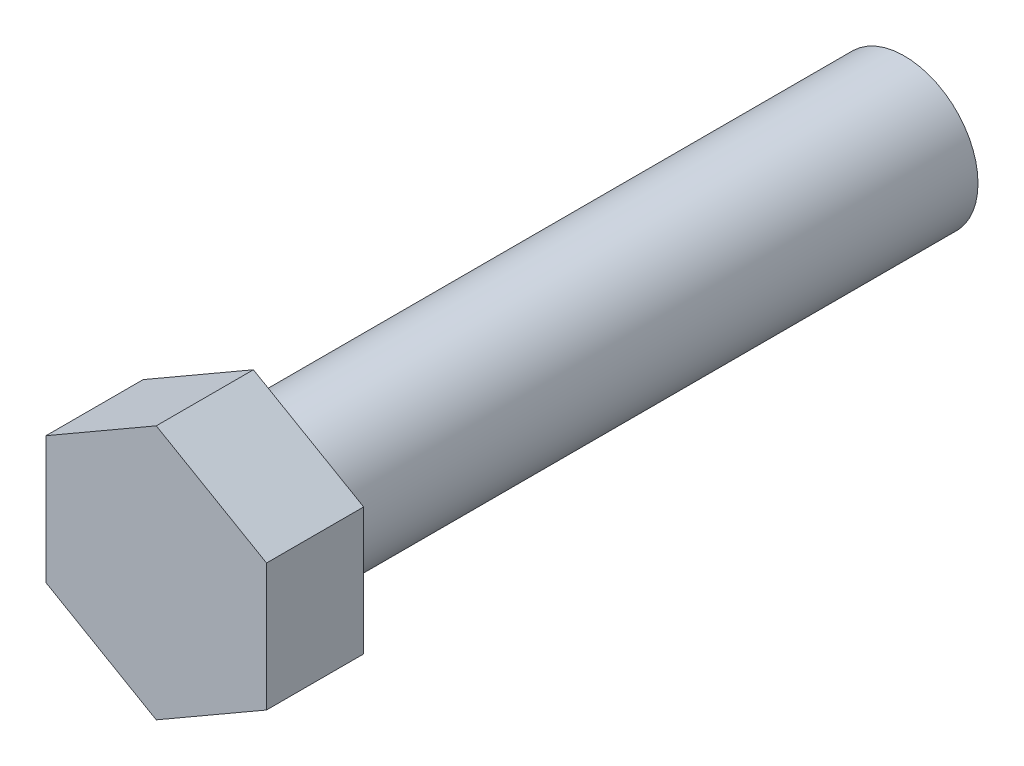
ISO-10303-21;
HEADER;
FILE_DESCRIPTION(('STEP AP214'),'2;1');
FILE_NAME('part.step','',(''),(''),'','','');
FILE_SCHEMA(('AUTOMOTIVE_DESIGN { 1 0 10303 214 1 1 1 1 }'));
ENDSEC;
DATA;
#1=APPLICATION_CONTEXT('core data for automotive mechanical design processes');
#2=APPLICATION_PROTOCOL_DEFINITION('international standard','automotive_design',2000,#1);
#3=PRODUCT_CONTEXT('',#1,'mechanical');
#4=PRODUCT('Part','Part','',(#3));
#5=PRODUCT_RELATED_PRODUCT_CATEGORY('part','',(#4));
#6=PRODUCT_DEFINITION_FORMATION('','',#4);
#7=PRODUCT_DEFINITION_CONTEXT('part definition',#1,'design');
#8=PRODUCT_DEFINITION('design','',#6,#7);
#9=PRODUCT_DEFINITION_SHAPE('','',#8);
#10=(LENGTH_UNIT() NAMED_UNIT(*) SI_UNIT(.MILLI.,.METRE.));
#11=(NAMED_UNIT(*) PLANE_ANGLE_UNIT() SI_UNIT($,.RADIAN.));
#12=(NAMED_UNIT(*) SI_UNIT($,.STERADIAN.) SOLID_ANGLE_UNIT());
#13=UNCERTAINTY_MEASURE_WITH_UNIT(LENGTH_MEASURE(1.E-05),#10,'distance_accuracy_value','');
#14=(GEOMETRIC_REPRESENTATION_CONTEXT(3) GLOBAL_UNCERTAINTY_ASSIGNED_CONTEXT((#13)) GLOBAL_UNIT_ASSIGNED_CONTEXT((#10,
#11,#12)) REPRESENTATION_CONTEXT('',''));
#15=CARTESIAN_POINT('',(0.,0.,0.));
#16=DIRECTION('',(0.,0.,1.));
#17=DIRECTION('',(1.,0.,0.));
#18=AXIS2_PLACEMENT_3D('',#15,#16,#17);
#19=CARTESIAN_POINT('',(66.675,38.4948291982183,58.7375));
#20=DIRECTION('',(-0.5,-0.866025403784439,0.));
#21=DIRECTION('',(0.866025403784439,-0.5,0.));
#22=AXIS2_PLACEMENT_3D('',#19,#20,#21);
#23=PLANE('',#22);
#24=DIRECTION('',(-0.866025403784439,0.5,0.));
#25=VECTOR('',#24,1.);
#26=CARTESIAN_POINT('',(66.675,38.4948291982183,0.));
#27=LINE('',#26,#25);
#28=CARTESIAN_POINT('',(66.675,38.4948291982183,0.));
#29=VERTEX_POINT('',#28);
#30=CARTESIAN_POINT('',(0.,76.9896583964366,0.));
#31=VERTEX_POINT('',#30);
#32=EDGE_CURVE('E132',#29,#31,#27,.T.);
#33=ORIENTED_EDGE('',*,*,#32,.T.);
#34=DIRECTION('',(0.,0.,-1.));
#35=VECTOR('',#34,1.);
#36=CARTESIAN_POINT('',(0.,76.9896583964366,58.7375));
#37=LINE('',#36,#35);
#38=CARTESIAN_POINT('',(0.,76.9896583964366,58.7375));
#39=VERTEX_POINT('',#38);
#40=EDGE_CURVE('E11',#39,#31,#37,.T.);
#41=ORIENTED_EDGE('',*,*,#40,.F.);
#42=DIRECTION('',(-0.866025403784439,0.5,0.));
#43=VECTOR('',#42,1.);
#44=CARTESIAN_POINT('',(66.675,38.4948291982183,58.7375));
#45=LINE('',#44,#43);
#46=CARTESIAN_POINT('',(66.675,38.4948291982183,58.7375));
#47=VERTEX_POINT('',#46);
#48=EDGE_CURVE('E147',#47,#39,#45,.T.);
#49=ORIENTED_EDGE('',*,*,#48,.F.);
#50=DIRECTION('',(0.,0.,-1.));
#51=VECTOR('',#50,1.);
#52=CARTESIAN_POINT('',(66.675,38.4948291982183,58.7375));
#53=LINE('',#52,#51);
#54=EDGE_CURVE('E129',#47,#29,#53,.T.);
#55=ORIENTED_EDGE('',*,*,#54,.T.);
#56=EDGE_LOOP('',(#33,#41,#49,#55));
#57=FACE_BOUND('',#56,.T.);
#58=ADVANCED_FACE('F42',(#57),#23,.F.);
#59=CARTESIAN_POINT('',(0.,76.9896583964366,58.7375));
#60=DIRECTION('',(0.5,-0.866025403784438,0.));
#61=DIRECTION('',(0.866025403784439,0.5,0.));
#62=AXIS2_PLACEMENT_3D('',#59,#60,#61);
#63=PLANE('',#62);
#64=DIRECTION('',(-0.866025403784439,-0.5,0.));
#65=VECTOR('',#64,1.);
#66=CARTESIAN_POINT('',(0.,76.9896583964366,0.));
#67=LINE('',#66,#65);
#68=CARTESIAN_POINT('',(-66.6750000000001,38.4948291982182,0.));
#69=VERTEX_POINT('',#68);
#70=EDGE_CURVE('E140',#31,#69,#67,.T.);
#71=ORIENTED_EDGE('',*,*,#70,.T.);
#72=DIRECTION('',(0.,0.,-1.));
#73=VECTOR('',#72,1.);
#74=CARTESIAN_POINT('',(-66.6750000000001,38.4948291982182,58.7375));
#75=LINE('',#74,#73);
#76=CARTESIAN_POINT('',(-66.6750000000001,38.4948291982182,58.7375));
#77=VERTEX_POINT('',#76);
#78=EDGE_CURVE('E52',#77,#69,#75,.T.);
#79=ORIENTED_EDGE('',*,*,#78,.F.);
#80=DIRECTION('',(-0.866025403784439,-0.5,0.));
#81=VECTOR('',#80,1.);
#82=CARTESIAN_POINT('',(0.,76.9896583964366,58.7375));
#83=LINE('',#82,#81);
#84=EDGE_CURVE('E98',#39,#77,#83,.T.);
#85=ORIENTED_EDGE('',*,*,#84,.F.);
#86=ORIENTED_EDGE('',*,*,#40,.T.);
#87=EDGE_LOOP('',(#71,#79,#85,#86));
#88=FACE_BOUND('',#87,.T.);
#89=ADVANCED_FACE('F176',(#88),#63,.F.);
#90=CARTESIAN_POINT('',(-66.6750000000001,38.4948291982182,58.7375));
#91=DIRECTION('',(1.,0.,0.));
#92=DIRECTION('',(0.,1.,0.));
#93=AXIS2_PLACEMENT_3D('',#90,#91,#92);
#94=PLANE('',#93);
#95=DIRECTION('',(0.,-1.,0.));
#96=VECTOR('',#95,1.);
#97=CARTESIAN_POINT('',(-66.6750000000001,38.4948291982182,0.));
#98=LINE('',#97,#96);
#99=CARTESIAN_POINT('',(-66.6750000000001,-38.4948291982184,0.));
#100=VERTEX_POINT('',#99);
#101=EDGE_CURVE('E143',#69,#100,#98,.T.);
#102=ORIENTED_EDGE('',*,*,#101,.T.);
#103=DIRECTION('',(0.,0.,-1.));
#104=VECTOR('',#103,1.);
#105=CARTESIAN_POINT('',(-66.6750000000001,-38.4948291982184,58.7375));
#106=LINE('',#105,#104);
#107=CARTESIAN_POINT('',(-66.6750000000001,-38.4948291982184,58.7375));
#108=VERTEX_POINT('',#107);
#109=EDGE_CURVE('E125',#108,#100,#106,.T.);
#110=ORIENTED_EDGE('',*,*,#109,.F.);
#111=DIRECTION('',(0.,-1.,0.));
#112=VECTOR('',#111,1.);
#113=CARTESIAN_POINT('',(-66.6750000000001,38.4948291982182,58.7375));
#114=LINE('',#113,#112);
#115=EDGE_CURVE('E112',#77,#108,#114,.T.);
#116=ORIENTED_EDGE('',*,*,#115,.F.);
#117=ORIENTED_EDGE('',*,*,#78,.T.);
#118=EDGE_LOOP('',(#102,#110,#116,#117));
#119=FACE_BOUND('',#118,.T.);
#120=ADVANCED_FACE('F159',(#119),#94,.F.);
#121=CARTESIAN_POINT('',(-66.6750000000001,-38.4948291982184,58.7375));
#122=DIRECTION('',(0.5,0.866025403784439,0.));
#123=DIRECTION('',(-0.866025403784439,0.5,0.));
#124=AXIS2_PLACEMENT_3D('',#121,#122,#123);
#125=PLANE('',#124);
#126=DIRECTION('',(0.866025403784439,-0.5,0.));
#127=VECTOR('',#126,1.);
#128=CARTESIAN_POINT('',(-66.6750000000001,-38.4948291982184,0.));
#129=LINE('',#128,#127);
#130=CARTESIAN_POINT('',(0.,-76.9896583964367,0.));
#131=VERTEX_POINT('',#130);
#132=EDGE_CURVE('E119',#100,#131,#129,.T.);
#133=ORIENTED_EDGE('',*,*,#132,.T.);
#134=DIRECTION('',(0.,0.,-1.));
#135=VECTOR('',#134,1.);
#136=CARTESIAN_POINT('',(0.,-76.9896583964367,58.7375));
#137=LINE('',#136,#135);
#138=CARTESIAN_POINT('',(0.,-76.9896583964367,58.7375));
#139=VERTEX_POINT('',#138);
#140=EDGE_CURVE('E120',#139,#131,#137,.T.);
#141=ORIENTED_EDGE('',*,*,#140,.F.);
#142=DIRECTION('',(0.866025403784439,-0.5,0.));
#143=VECTOR('',#142,1.);
#144=CARTESIAN_POINT('',(-66.6750000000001,-38.4948291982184,58.7375));
#145=LINE('',#144,#143);
#146=EDGE_CURVE('E104',#108,#139,#145,.T.);
#147=ORIENTED_EDGE('',*,*,#146,.F.);
#148=ORIENTED_EDGE('',*,*,#109,.T.);
#149=EDGE_LOOP('',(#133,#141,#147,#148));
#150=FACE_BOUND('',#149,.T.);
#151=ADVANCED_FACE('F117',(#150),#125,.F.);
#152=CARTESIAN_POINT('',(0.,-76.9896583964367,58.7375));
#153=DIRECTION('',(-0.5,0.866025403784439,0.));
#154=DIRECTION('',(-0.866025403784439,-0.5,0.));
#155=AXIS2_PLACEMENT_3D('',#152,#153,#154);
#156=PLANE('',#155);
#157=DIRECTION('',(0.866025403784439,0.5,0.));
#158=VECTOR('',#157,1.);
#159=CARTESIAN_POINT('',(0.,-76.9896583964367,0.));
#160=LINE('',#159,#158);
#161=CARTESIAN_POINT('',(66.675,-38.4948291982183,0.));
#162=VERTEX_POINT('',#161);
#163=EDGE_CURVE('E84',#131,#162,#160,.T.);
#164=ORIENTED_EDGE('',*,*,#163,.T.);
#165=DIRECTION('',(0.,0.,-1.));
#166=VECTOR('',#165,1.);
#167=CARTESIAN_POINT('',(66.675,-38.4948291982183,58.7375));
#168=LINE('',#167,#166);
#169=CARTESIAN_POINT('',(66.675,-38.4948291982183,58.7375));
#170=VERTEX_POINT('',#169);
#171=EDGE_CURVE('E121',#170,#162,#168,.T.);
#172=ORIENTED_EDGE('',*,*,#171,.F.);
#173=DIRECTION('',(0.866025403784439,0.5,0.));
#174=VECTOR('',#173,1.);
#175=CARTESIAN_POINT('',(0.,-76.9896583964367,58.7375));
#176=LINE('',#175,#174);
#177=EDGE_CURVE('E108',#139,#170,#176,.T.);
#178=ORIENTED_EDGE('',*,*,#177,.F.);
#179=ORIENTED_EDGE('',*,*,#140,.T.);
#180=EDGE_LOOP('',(#164,#172,#178,#179));
#181=FACE_BOUND('',#180,.T.);
#182=ADVANCED_FACE('F122',(#181),#156,.F.);
#183=CARTESIAN_POINT('',(66.675,-38.4948291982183,58.7375));
#184=DIRECTION('',(-1.,0.,0.));
#185=DIRECTION('',(0.,0.,1.));
#186=AXIS2_PLACEMENT_3D('',#183,#184,#185);
#187=PLANE('',#186);
#188=DIRECTION('',(0.,1.,0.));
#189=VECTOR('',#188,1.);
#190=CARTESIAN_POINT('',(66.675,-38.4948291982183,0.));
#191=LINE('',#190,#189);
#192=EDGE_CURVE('E89',#162,#29,#191,.T.);
#193=ORIENTED_EDGE('',*,*,#192,.T.);
#194=ORIENTED_EDGE('',*,*,#54,.F.);
#195=DIRECTION('',(0.,1.,0.));
#196=VECTOR('',#195,1.);
#197=CARTESIAN_POINT('',(66.675,-38.4948291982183,58.7375));
#198=LINE('',#197,#196);
#199=EDGE_CURVE('E61',#170,#47,#198,.T.);
#200=ORIENTED_EDGE('',*,*,#199,.F.);
#201=ORIENTED_EDGE('',*,*,#171,.T.);
#202=EDGE_LOOP('',(#193,#194,#200,#201));
#203=FACE_BOUND('',#202,.T.);
#204=ADVANCED_FACE('F170',(#203),#187,.F.);
#205=CARTESIAN_POINT('',(0.,0.,58.7375));
#206=DIRECTION('',(0.,0.,1.));
#207=DIRECTION('',(1.,0.,0.));
#208=AXIS2_PLACEMENT_3D('',#205,#206,#207);
#209=PLANE('',#208);
#210=ORIENTED_EDGE('',*,*,#48,.T.);
#211=ORIENTED_EDGE('',*,*,#84,.T.);
#212=ORIENTED_EDGE('',*,*,#115,.T.);
#213=ORIENTED_EDGE('',*,*,#146,.T.);
#214=ORIENTED_EDGE('',*,*,#177,.T.);
#215=ORIENTED_EDGE('',*,*,#199,.T.);
#216=EDGE_LOOP('',(#210,#211,#212,#213,#214,#215));
#217=FACE_BOUND('',#216,.T.);
#218=ADVANCED_FACE('F110',(#217),#209,.T.);
#219=CARTESIAN_POINT('',(0.,0.,0.));
#220=DIRECTION('',(0.,0.,1.));
#221=DIRECTION('',(1.,0.,0.));
#222=AXIS2_PLACEMENT_3D('',#219,#220,#221);
#223=PLANE('',#222);
#224=CARTESIAN_POINT('',(0.,0.,0.));
#225=DIRECTION('',(0.,0.,1.));
#226=DIRECTION('',(1.,0.,0.));
#227=AXIS2_PLACEMENT_3D('',#224,#225,#226);
#228=CIRCLE('',#227,44.45);
#229=CARTESIAN_POINT('',(44.45,0.,0.));
#230=VERTEX_POINT('',#229);
#231=EDGE_CURVE('E245',#230,#230,#228,.T.);
#232=ORIENTED_EDGE('',*,*,#231,.T.);
#233=EDGE_LOOP('',(#232));
#234=FACE_BOUND('',#233,.T.);
#235=ORIENTED_EDGE('',*,*,#32,.F.);
#236=ORIENTED_EDGE('',*,*,#192,.F.);
#237=ORIENTED_EDGE('',*,*,#163,.F.);
#238=ORIENTED_EDGE('',*,*,#132,.F.);
#239=ORIENTED_EDGE('',*,*,#101,.F.);
#240=ORIENTED_EDGE('',*,*,#70,.F.);
#241=EDGE_LOOP('',(#235,#236,#237,#238,#239,#240));
#242=FACE_BOUND('',#241,.T.);
#243=ADVANCED_FACE('F162',(#234,#242),#223,.F.);
#244=CARTESIAN_POINT('',(0.,0.,-393.7));
#245=DIRECTION('',(0.,0.,1.));
#246=DIRECTION('',(1.,0.,0.));
#247=AXIS2_PLACEMENT_3D('',#244,#245,#246);
#248=CYLINDRICAL_SURFACE('',#247,44.45);
#249=CARTESIAN_POINT('',(0.,0.,-393.7));
#250=DIRECTION('',(0.,0.,1.));
#251=DIRECTION('',(1.,0.,0.));
#252=AXIS2_PLACEMENT_3D('',#249,#250,#251);
#253=CIRCLE('',#252,44.45);
#254=CARTESIAN_POINT('',(44.45,0.,-393.7));
#255=VERTEX_POINT('',#254);
#256=EDGE_CURVE('E136',#255,#255,#253,.T.);
#257=ORIENTED_EDGE('',*,*,#256,.T.);
#258=EDGE_LOOP('',(#257));
#259=FACE_BOUND('',#258,.T.);
#260=ORIENTED_EDGE('',*,*,#231,.F.);
#261=EDGE_LOOP('',(#260));
#262=FACE_BOUND('',#261,.T.);
#263=ADVANCED_FACE('F220',(#259,#262),#248,.T.);
#264=CARTESIAN_POINT('',(0.,0.,-393.7));
#265=DIRECTION('',(0.,0.,1.));
#266=DIRECTION('',(1.,0.,0.));
#267=AXIS2_PLACEMENT_3D('',#264,#265,#266);
#268=PLANE('',#267);
#269=ORIENTED_EDGE('',*,*,#256,.F.);
#270=EDGE_LOOP('',(#269));
#271=FACE_BOUND('',#270,.T.);
#272=ADVANCED_FACE('F226',(#271),#268,.F.);
#273=CLOSED_SHELL('',(#58,#89,#120,#151,#182,#204,#218,#243,#263,#272));
#274=MANIFOLD_SOLID_BREP('B2',#273);
#275=ADVANCED_BREP_SHAPE_REPRESENTATION('',(#18,#274),#14);
#276=SHAPE_DEFINITION_REPRESENTATION(#9,#275);
ENDSEC;
END-ISO-10303-21;
